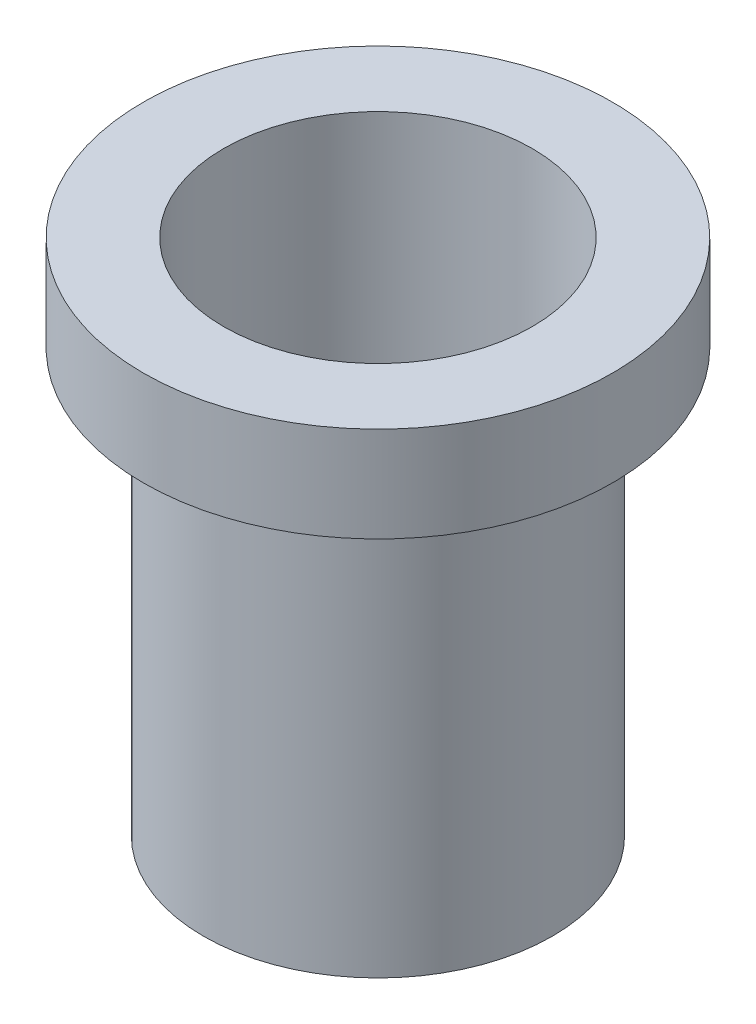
from build123d import *


with BuildPart() as part:
    # Sketch2 → Revolve1 (revolve)
    with BuildSketch(Plane.XY, mode=Mode.PRIVATE) as revolve1_sk:
        Polygon((46.355, 0), (70.485, 0), (70.485, -28.575), (52.3875, -28.575), (52.3875, -155.575), (46.355, -155.575), align=None)
    revolve(revolve1_sk.sketch.rotate(Axis((0, 11.515626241, 0), (0, -1, 0)), 90), axis=Axis((0, 11.515626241, 0), (0, -1, 0)))


solid = part.part
